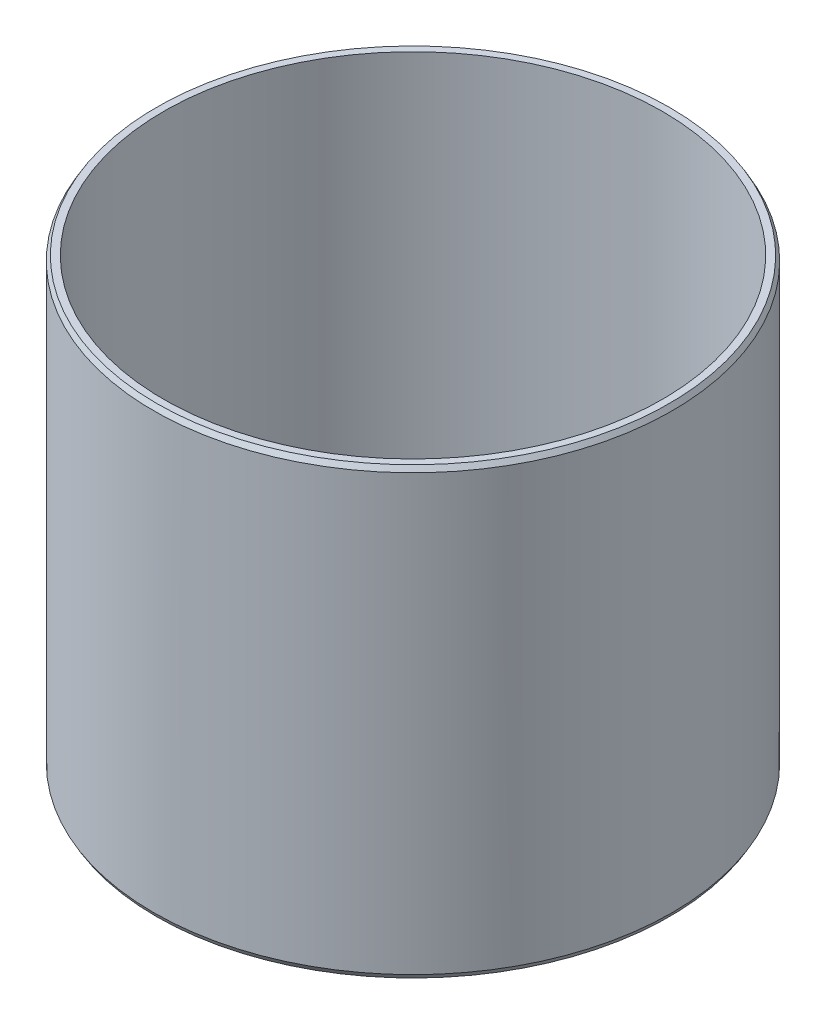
ISO-10303-21;
HEADER;
FILE_DESCRIPTION(('STEP AP214'),'2;1');
FILE_NAME('part.step','',(''),(''),'','','');
FILE_SCHEMA(('AUTOMOTIVE_DESIGN { 1 0 10303 214 1 1 1 1 }'));
ENDSEC;
DATA;
#1=APPLICATION_CONTEXT('core data for automotive mechanical design processes');
#2=APPLICATION_PROTOCOL_DEFINITION('international standard','automotive_design',2000,#1);
#3=PRODUCT_CONTEXT('',#1,'mechanical');
#4=PRODUCT('Part','Part','',(#3));
#5=PRODUCT_RELATED_PRODUCT_CATEGORY('part','',(#4));
#6=PRODUCT_DEFINITION_FORMATION('','',#4);
#7=PRODUCT_DEFINITION_CONTEXT('part definition',#1,'design');
#8=PRODUCT_DEFINITION('design','',#6,#7);
#9=PRODUCT_DEFINITION_SHAPE('','',#8);
#10=(LENGTH_UNIT() NAMED_UNIT(*) SI_UNIT(.MILLI.,.METRE.));
#11=(NAMED_UNIT(*) PLANE_ANGLE_UNIT() SI_UNIT($,.RADIAN.));
#12=(NAMED_UNIT(*) SI_UNIT($,.STERADIAN.) SOLID_ANGLE_UNIT());
#13=UNCERTAINTY_MEASURE_WITH_UNIT(LENGTH_MEASURE(1.E-05),#10,'distance_accuracy_value','');
#14=(GEOMETRIC_REPRESENTATION_CONTEXT(3) GLOBAL_UNCERTAINTY_ASSIGNED_CONTEXT((#13)) GLOBAL_UNIT_ASSIGNED_CONTEXT((#10,
#11,#12)) REPRESENTATION_CONTEXT('',''));
#15=CARTESIAN_POINT('',(0.,0.,0.));
#16=DIRECTION('',(0.,0.,1.));
#17=DIRECTION('',(1.,0.,0.));
#18=AXIS2_PLACEMENT_3D('',#15,#16,#17);
#19=CARTESIAN_POINT('',(0.,90.,0.));
#20=DIRECTION('',(0.,1.,0.));
#21=DIRECTION('',(0.,0.,1.));
#22=AXIS2_PLACEMENT_3D('',#19,#20,#21);
#23=PLANE('',#22);
#24=CARTESIAN_POINT('',(0.,90.,0.));
#25=DIRECTION('',(0.,1.,0.));
#26=DIRECTION('',(0.,0.,1.));
#27=AXIS2_PLACEMENT_3D('',#24,#25,#26);
#28=CIRCLE('',#27,51.9226497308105);
#29=CARTESIAN_POINT('',(0.,90.,51.9226497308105));
#30=VERTEX_POINT('',#29);
#31=EDGE_CURVE('E49',#30,#30,#28,.T.);
#32=ORIENTED_EDGE('',*,*,#31,.T.);
#33=EDGE_LOOP('',(#32));
#34=FACE_BOUND('',#33,.T.);
#35=CARTESIAN_POINT('',(0.,90.,0.));
#36=DIRECTION('',(0.,1.,0.));
#37=DIRECTION('',(0.,0.,1.));
#38=AXIS2_PLACEMENT_3D('',#35,#36,#37);
#39=CIRCLE('',#38,50.5);
#40=CARTESIAN_POINT('',(0.,90.,-50.5));
#41=VERTEX_POINT('',#40);
#42=EDGE_CURVE('E54',#41,#41,#39,.T.);
#43=ORIENTED_EDGE('',*,*,#42,.F.);
#44=EDGE_LOOP('',(#43));
#45=FACE_BOUND('',#44,.T.);
#46=ADVANCED_FACE('F34',(#34,#45),#23,.T.);
#47=CARTESIAN_POINT('',(0.,0.,0.));
#48=DIRECTION('',(0.,1.,0.));
#49=DIRECTION('',(0.,0.,1.));
#50=AXIS2_PLACEMENT_3D('',#47,#48,#49);
#51=PLANE('',#50);
#52=CARTESIAN_POINT('',(0.,0.,0.));
#53=DIRECTION('',(0.,1.,0.));
#54=DIRECTION('',(0.,0.,1.));
#55=AXIS2_PLACEMENT_3D('',#52,#53,#54);
#56=CIRCLE('',#55,51.9226497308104);
#57=CARTESIAN_POINT('',(0.,0.,51.9226497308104));
#58=VERTEX_POINT('',#57);
#59=EDGE_CURVE('E11',#58,#58,#56,.F.);
#60=ORIENTED_EDGE('',*,*,#59,.T.);
#61=EDGE_LOOP('',(#60));
#62=FACE_BOUND('',#61,.T.);
#63=CARTESIAN_POINT('',(0.,0.,0.));
#64=DIRECTION('',(0.,1.,0.));
#65=DIRECTION('',(0.,0.,1.));
#66=AXIS2_PLACEMENT_3D('',#63,#64,#65);
#67=CIRCLE('',#66,50.5);
#68=CARTESIAN_POINT('',(0.,0.,-50.5));
#69=VERTEX_POINT('',#68);
#70=EDGE_CURVE('E55',#69,#69,#67,.T.);
#71=ORIENTED_EDGE('',*,*,#70,.T.);
#72=EDGE_LOOP('',(#71));
#73=FACE_BOUND('',#72,.T.);
#74=ADVANCED_FACE('F65',(#62,#73),#51,.F.);
#75=CARTESIAN_POINT('',(0.,90.,0.));
#76=DIRECTION('',(0.,-1.,0.));
#77=DIRECTION('',(0.,0.,-1.));
#78=AXIS2_PLACEMENT_3D('',#75,#76,#77);
#79=CYLINDRICAL_SURFACE('',#78,52.5);
#80=CARTESIAN_POINT('',(0.,89.0000000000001,0.));
#81=DIRECTION('',(0.,1.,0.));
#82=DIRECTION('',(0.,0.,1.));
#83=AXIS2_PLACEMENT_3D('',#80,#81,#82);
#84=CIRCLE('',#83,52.5);
#85=CARTESIAN_POINT('',(0.,89.0000000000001,-52.5));
#86=VERTEX_POINT('',#85);
#87=EDGE_CURVE('E41',#86,#86,#84,.F.);
#88=CARTESIAN_POINT('',(0.,0.999999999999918,0.));
#89=DIRECTION('',(0.,1.,0.));
#90=DIRECTION('',(0.,0.,1.));
#91=AXIS2_PLACEMENT_3D('',#88,#89,#90);
#92=CIRCLE('',#91,52.5);
#93=CARTESIAN_POINT('',(0.,0.999999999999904,-52.5));
#94=VERTEX_POINT('',#93);
#95=EDGE_CURVE('E45',#94,#94,#92,.T.);
#96=CARTESIAN_POINT('',(0.,89.0000000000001,-52.5));
#97=CARTESIAN_POINT('',(0.,88.0833333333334,-52.5));
#98=CARTESIAN_POINT('',(0.,87.1666666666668,-52.5));
#99=CARTESIAN_POINT('',(0.,85.3333333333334,-52.5));
#100=CARTESIAN_POINT('',(0.,84.4166666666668,-52.5));
#101=CARTESIAN_POINT('',(0.,82.5833333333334,-52.5));
#102=CARTESIAN_POINT('',(0.,81.6666666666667,-52.5));
#103=CARTESIAN_POINT('',(0.,79.8333333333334,-52.5));
#104=CARTESIAN_POINT('',(0.,78.9166666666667,-52.5));
#105=CARTESIAN_POINT('',(0.,77.0833333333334,-52.5));
#106=CARTESIAN_POINT('',(0.,76.1666666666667,-52.5));
#107=CARTESIAN_POINT('',(0.,74.3333333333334,-52.5));
#108=CARTESIAN_POINT('',(0.,73.4166666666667,-52.5));
#109=CARTESIAN_POINT('',(0.,71.5833333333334,-52.5));
#110=CARTESIAN_POINT('',(0.,70.6666666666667,-52.5));
#111=CARTESIAN_POINT('',(0.,68.8333333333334,-52.5));
#112=CARTESIAN_POINT('',(0.,67.9166666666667,-52.5));
#113=CARTESIAN_POINT('',(0.,66.0833333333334,-52.5));
#114=CARTESIAN_POINT('',(0.,65.1666666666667,-52.5));
#115=CARTESIAN_POINT('',(0.,63.3333333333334,-52.5));
#116=CARTESIAN_POINT('',(0.,62.4166666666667,-52.5));
#117=CARTESIAN_POINT('',(0.,60.5833333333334,-52.5));
#118=CARTESIAN_POINT('',(0.,59.6666666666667,-52.5));
#119=CARTESIAN_POINT('',(0.,57.8333333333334,-52.5));
#120=CARTESIAN_POINT('',(0.,56.9166666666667,-52.5));
#121=CARTESIAN_POINT('',(0.,55.0833333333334,-52.5));
#122=CARTESIAN_POINT('',(0.,54.1666666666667,-52.5));
#123=CARTESIAN_POINT('',(0.,52.3333333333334,-52.5));
#124=CARTESIAN_POINT('',(0.,51.4166666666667,-52.5));
#125=CARTESIAN_POINT('',(0.,49.5833333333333,-52.5));
#126=CARTESIAN_POINT('',(0.,48.6666666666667,-52.5));
#127=CARTESIAN_POINT('',(0.,46.8333333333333,-52.5));
#128=CARTESIAN_POINT('',(0.,45.9166666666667,-52.5));
#129=CARTESIAN_POINT('',(0.,44.0833333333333,-52.5));
#130=CARTESIAN_POINT('',(0.,43.1666666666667,-52.5));
#131=CARTESIAN_POINT('',(0.,41.3333333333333,-52.5));
#132=CARTESIAN_POINT('',(0.,40.4166666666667,-52.5));
#133=CARTESIAN_POINT('',(0.,38.5833333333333,-52.5));
#134=CARTESIAN_POINT('',(0.,37.6666666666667,-52.5));
#135=CARTESIAN_POINT('',(0.,35.8333333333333,-52.5));
#136=CARTESIAN_POINT('',(0.,34.9166666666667,-52.5));
#137=CARTESIAN_POINT('',(0.,33.0833333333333,-52.5));
#138=CARTESIAN_POINT('',(0.,32.1666666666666,-52.5));
#139=CARTESIAN_POINT('',(0.,30.3333333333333,-52.5));
#140=CARTESIAN_POINT('',(0.,29.4166666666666,-52.5));
#141=CARTESIAN_POINT('',(0.,27.5833333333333,-52.5));
#142=CARTESIAN_POINT('',(0.,26.6666666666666,-52.5));
#143=CARTESIAN_POINT('',(0.,24.8333333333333,-52.5));
#144=CARTESIAN_POINT('',(0.,23.9166666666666,-52.5));
#145=CARTESIAN_POINT('',(0.,22.0833333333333,-52.5));
#146=CARTESIAN_POINT('',(0.,21.1666666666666,-52.5));
#147=CARTESIAN_POINT('',(0.,19.3333333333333,-52.5));
#148=CARTESIAN_POINT('',(0.,18.4166666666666,-52.5));
#149=CARTESIAN_POINT('',(0.,16.5833333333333,-52.5));
#150=CARTESIAN_POINT('',(0.,15.6666666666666,-52.5));
#151=CARTESIAN_POINT('',(0.,13.8333333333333,-52.5));
#152=CARTESIAN_POINT('',(0.,12.9166666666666,-52.5));
#153=CARTESIAN_POINT('',(0.,11.0833333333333,-52.5));
#154=CARTESIAN_POINT('',(0.,10.1666666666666,-52.5));
#155=CARTESIAN_POINT('',(0.,8.33333333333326,-52.5));
#156=CARTESIAN_POINT('',(0.,7.41666666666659,-52.5));
#157=CARTESIAN_POINT('',(0.,5.58333333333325,-52.5));
#158=CARTESIAN_POINT('',(0.,4.66666666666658,-52.5));
#159=CARTESIAN_POINT('',(0.,2.83333333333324,-52.5));
#160=CARTESIAN_POINT('',(0.,1.91666666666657,-52.5));
#161=CARTESIAN_POINT('',(0.,0.999999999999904,-52.5));
#162=B_SPLINE_CURVE_WITH_KNOTS('',3,(#96,#97,#98,#99,#100,#101,#102,#103,#104,#105,#106,#107,
#108,#109,#110,#111,#112,#113,#114,#115,#116,#117,#118,#119,#120,#121,#122,#123,#124,#125,#126,
#127,#128,#129,#130,#131,#132,#133,#134,#135,#136,#137,#138,#139,#140,#141,#142,#143,#144,#145,
#146,#147,#148,#149,#150,#151,#152,#153,#154,#155,#156,#157,#158,#159,#160,#161),.UNSPECIFIED.,
.F.,.F.,(4,2,2,2,2,2,2,2,2,2,2,2,2,2,2,2,2,2,2,2,2,2,2,2,2,2,2,2,2,2,2,2,4),(0.,2.75,
5.50000000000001,8.25000000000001,11.,13.75,16.5,19.25,22.,24.75,27.5000000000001,
30.2500000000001,33.0000000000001,35.7500000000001,38.5000000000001,41.2500000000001,
44.0000000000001,46.7500000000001,49.5000000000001,52.2500000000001,55.0000000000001,
57.7500000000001,60.5000000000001,63.2500000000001,66.0000000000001,68.7500000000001,
71.5000000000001,74.2500000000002,77.0000000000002,79.7500000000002,82.5000000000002,
85.2500000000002,88.0000000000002),.UNSPECIFIED.);
#163=EDGE_CURVE('BSEAM71',#86,#94,#162,.T.);
#164=ORIENTED_EDGE('',*,*,#87,.T.);
#165=ORIENTED_EDGE('',*,*,#95,.T.);
#166=ORIENTED_EDGE('',*,*,#163,.T.);
#167=ORIENTED_EDGE('',*,*,#163,.F.);
#168=EDGE_LOOP('',(#164,#166,#165,#167));
#169=FACE_BOUND('',#168,.T.);
#170=ADVANCED_FACE('F71',(#169),#79,.T.);
#171=CARTESIAN_POINT('',(0.,90.,0.));
#172=DIRECTION('',(0.,-1.,0.));
#173=DIRECTION('',(0.,0.,-1.));
#174=AXIS2_PLACEMENT_3D('',#171,#172,#173);
#175=CYLINDRICAL_SURFACE('',#174,50.5);
#176=CARTESIAN_POINT('',(0.,90.,-50.5));
#177=CARTESIAN_POINT('',(0.,89.0625,-50.5));
#178=CARTESIAN_POINT('',(0.,88.125,-50.5));
#179=CARTESIAN_POINT('',(0.,86.25,-50.5));
#180=CARTESIAN_POINT('',(0.,85.3125,-50.5));
#181=CARTESIAN_POINT('',(0.,83.4375,-50.5));
#182=CARTESIAN_POINT('',(0.,82.5,-50.5));
#183=CARTESIAN_POINT('',(0.,80.625,-50.5));
#184=CARTESIAN_POINT('',(0.,79.6875,-50.5));
#185=CARTESIAN_POINT('',(0.,77.8125,-50.5));
#186=CARTESIAN_POINT('',(0.,76.875,-50.5));
#187=CARTESIAN_POINT('',(0.,75.,-50.5));
#188=CARTESIAN_POINT('',(0.,74.0625,-50.5));
#189=CARTESIAN_POINT('',(0.,72.1875,-50.5));
#190=CARTESIAN_POINT('',(0.,71.25,-50.5));
#191=CARTESIAN_POINT('',(0.,69.375,-50.5));
#192=CARTESIAN_POINT('',(0.,68.4375,-50.5));
#193=CARTESIAN_POINT('',(0.,66.5625,-50.5));
#194=CARTESIAN_POINT('',(0.,65.625,-50.5));
#195=CARTESIAN_POINT('',(0.,63.75,-50.5));
#196=CARTESIAN_POINT('',(0.,62.8125,-50.5));
#197=CARTESIAN_POINT('',(0.,60.9375,-50.5));
#198=CARTESIAN_POINT('',(0.,60.,-50.5));
#199=CARTESIAN_POINT('',(0.,58.125,-50.5));
#200=CARTESIAN_POINT('',(0.,57.1875,-50.5));
#201=CARTESIAN_POINT('',(0.,55.3125,-50.5));
#202=CARTESIAN_POINT('',(0.,54.375,-50.5));
#203=CARTESIAN_POINT('',(0.,52.5,-50.5));
#204=CARTESIAN_POINT('',(0.,51.5625,-50.5));
#205=CARTESIAN_POINT('',(0.,49.6875,-50.5));
#206=CARTESIAN_POINT('',(0.,48.75,-50.5));
#207=CARTESIAN_POINT('',(0.,46.875,-50.5));
#208=CARTESIAN_POINT('',(0.,45.9375,-50.5));
#209=CARTESIAN_POINT('',(0.,44.0625,-50.5));
#210=CARTESIAN_POINT('',(0.,43.125,-50.5));
#211=CARTESIAN_POINT('',(0.,41.25,-50.5));
#212=CARTESIAN_POINT('',(0.,40.3125,-50.5));
#213=CARTESIAN_POINT('',(0.,38.4375,-50.5));
#214=CARTESIAN_POINT('',(0.,37.5,-50.5));
#215=CARTESIAN_POINT('',(0.,35.625,-50.5));
#216=CARTESIAN_POINT('',(0.,34.6875,-50.5));
#217=CARTESIAN_POINT('',(0.,32.8125,-50.5));
#218=CARTESIAN_POINT('',(0.,31.875,-50.5));
#219=CARTESIAN_POINT('',(0.,30.,-50.5));
#220=CARTESIAN_POINT('',(0.,29.0625,-50.5));
#221=CARTESIAN_POINT('',(0.,27.1875,-50.5));
#222=CARTESIAN_POINT('',(0.,26.25,-50.5));
#223=CARTESIAN_POINT('',(0.,24.375,-50.5));
#224=CARTESIAN_POINT('',(0.,23.4375,-50.5));
#225=CARTESIAN_POINT('',(0.,21.5625,-50.5));
#226=CARTESIAN_POINT('',(0.,20.625,-50.5));
#227=CARTESIAN_POINT('',(0.,18.75,-50.5));
#228=CARTESIAN_POINT('',(0.,17.8125,-50.5));
#229=CARTESIAN_POINT('',(0.,15.9375,-50.5));
#230=CARTESIAN_POINT('',(0.,15.,-50.5));
#231=CARTESIAN_POINT('',(0.,13.125,-50.5));
#232=CARTESIAN_POINT('',(0.,12.1875,-50.5));
#233=CARTESIAN_POINT('',(0.,10.3125,-50.5));
#234=CARTESIAN_POINT('',(0.,9.37499999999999,-50.5));
#235=CARTESIAN_POINT('',(0.,7.49999999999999,-50.5));
#236=CARTESIAN_POINT('',(0.,6.56249999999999,-50.5));
#237=CARTESIAN_POINT('',(0.,4.68749999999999,-50.5));
#238=CARTESIAN_POINT('',(0.,3.74999999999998,-50.5));
#239=CARTESIAN_POINT('',(0.,1.87499999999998,-50.5));
#240=CARTESIAN_POINT('',(0.,0.937499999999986,-50.5));
#241=CARTESIAN_POINT('',(0.,0.,-50.5));
#242=B_SPLINE_CURVE_WITH_KNOTS('',3,(#176,#177,#178,#179,#180,#181,#182,#183,#184,#185,#186,
#187,#188,#189,#190,#191,#192,#193,#194,#195,#196,#197,#198,#199,#200,#201,#202,#203,#204,#205,
#206,#207,#208,#209,#210,#211,#212,#213,#214,#215,#216,#217,#218,#219,#220,#221,#222,#223,#224,
#225,#226,#227,#228,#229,#230,#231,#232,#233,#234,#235,#236,#237,#238,#239,#240,#241),
.UNSPECIFIED.,.F.,.F.,(4,2,2,2,2,2,2,2,2,2,2,2,2,2,2,2,2,2,2,2,2,2,2,2,2,2,2,2,2,2,2,2,4),(0.,
2.81250000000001,5.62500000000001,8.43750000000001,11.25,14.0625,16.875,19.6875,22.5,25.3125,
28.125,30.9375,33.75,36.5625,39.375,42.1875,45.,47.8125,50.625,53.4375,56.25,59.0625,61.875,
64.6875,67.5,70.3125,73.125,75.9375,78.75,81.5625,84.375,87.1875,90.),.UNSPECIFIED.);
#243=EDGE_CURVE('BSEAM61',#41,#69,#242,.T.);
#244=ORIENTED_EDGE('',*,*,#42,.T.);
#245=ORIENTED_EDGE('',*,*,#70,.F.);
#246=ORIENTED_EDGE('',*,*,#243,.T.);
#247=ORIENTED_EDGE('',*,*,#243,.F.);
#248=EDGE_LOOP('',(#244,#246,#245,#247));
#249=FACE_BOUND('',#248,.T.);
#250=ADVANCED_FACE('F61',(#249),#175,.F.);
#251=CARTESIAN_POINT('',(0.,90.,0.));
#252=DIRECTION('',(0.,-1.,0.));
#253=DIRECTION('',(0.,0.,-1.));
#254=AXIS2_PLACEMENT_3D('',#251,#252,#253);
#255=CONICAL_SURFACE('',#254,51.9226497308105,0.523598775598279);
#256=ORIENTED_EDGE('',*,*,#87,.F.);
#257=EDGE_LOOP('',(#256));
#258=FACE_BOUND('',#257,.T.);
#259=ORIENTED_EDGE('',*,*,#31,.F.);
#260=EDGE_LOOP('',(#259));
#261=FACE_BOUND('',#260,.T.);
#262=ADVANCED_FACE('F76',(#258,#261),#255,.T.);
#263=CARTESIAN_POINT('',(0.,0.999999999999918,0.));
#264=DIRECTION('',(0.,1.,0.));
#265=DIRECTION('',(0.,0.,1.));
#266=AXIS2_PLACEMENT_3D('',#263,#264,#265);
#267=CONICAL_SURFACE('',#266,52.5,0.523598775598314);
#268=ORIENTED_EDGE('',*,*,#59,.F.);
#269=EDGE_LOOP('',(#268));
#270=FACE_BOUND('',#269,.T.);
#271=ORIENTED_EDGE('',*,*,#95,.F.);
#272=EDGE_LOOP('',(#271));
#273=FACE_BOUND('',#272,.T.);
#274=ADVANCED_FACE('F36',(#270,#273),#267,.T.);
#275=CLOSED_SHELL('',(#46,#74,#170,#250,#262,#274));
#276=MANIFOLD_SOLID_BREP('B2',#275);
#277=ADVANCED_BREP_SHAPE_REPRESENTATION('',(#18,#276),#14);
#278=SHAPE_DEFINITION_REPRESENTATION(#9,#277);
ENDSEC;
END-ISO-10303-21;
